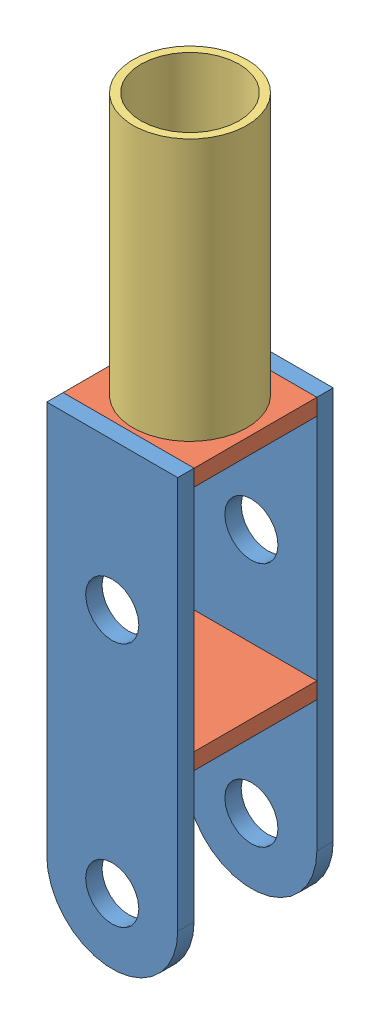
SolidWorks assembly Base Plate Adaptor Hinge.SLDASM, configuration Default (file format 10000). Lengths in mm.
Overall size (50.8 279.4 60.33).
5 component instances, 3 part files, 12 mates.
Components (placement in the parent):
- Base Adaptor-1: Base Adaptor.SLDPRT [Default] at (40.487 172.8879 139.5327) size (50.8 177.8 6.35)
- Base Adaptor-2: Base Adaptor.SLDPRT [Default] at (40.487 172.8879 85.5577) size (50.8 177.8 6.35)
- Base Adaptor Spacer-1: Base Adaptor Spacer.SLDPRT [Default] at (40.487 172.8879 91.9077) x (1 0 0) z (0 -1 0) size (50.8 47.62 6.35)
- Base Adaptor Spacer-2: Base Adaptor Spacer.SLDPRT [Default] at (40.487 77.6379 91.9077) x (1 0 0) z (0 -1 0) size (50.8 47.62 6.35)
- 1.5 ID Tubing-1: 1.5 ID Tubing.SLDPRT [Default] at (65.887 223.6879 115.7202) size (44.2 101.6 44.2)
Mates (geometry in assembly coordinates):
- Coincident1: coincident aligned: plane of Base Adaptor-1 through (91.287 20.4879 145.8827) normal (1 0 0); plane of Base Adaptor-2 through (91.287 20.4879 91.9077) normal (1 0 0)
- Coincident2: coincident aligned: plane of Base Adaptor-1 through (91.287 172.8879 145.8827) normal (0 1 0); plane of Base Adaptor-2 through (91.287 172.8879 91.9077) normal (0 1 0)
- Coincident3: coincident anti-aligned: plane of Base Adaptor-1 through (65.887 20.4879 139.5327) normal (0 0 -1); plane of Base Adaptor Spacer-1 through (40.487 166.5379 139.5327) normal (0 0 1)
- Coincident4: coincident aligned: plane of Base Adaptor-1 through (91.287 20.4879 145.8827) normal (1 0 0); plane of Base Adaptor Spacer-1 through (91.287 166.5379 91.9077) normal (1 0 0)
- Coincident5: coincident aligned: plane of Base Adaptor-1 through (91.287 172.8879 145.8827) normal (0 1 0); plane of Base Adaptor Spacer-1 through (40.487 172.8879 91.9077) normal (0 1 0)
- Coincident6: coincident anti-aligned: plane of Base Adaptor-2 through (65.887 20.4879 91.9077) normal (0 0 1); plane of Base Adaptor Spacer-1 through (40.487 166.5379 91.9077) normal (0 0 -1)
- Coincident7: coincident anti-aligned: plane of Base Adaptor-1 through (65.887 20.4879 139.5327) normal (0 0 -1); plane of Base Adaptor Spacer-2 through (40.487 71.2879 139.5327) normal (0 0 1)
- Coincident8: coincident aligned: plane of Base Adaptor-1 through (91.287 20.4879 145.8827) normal (1 0 0); plane of Base Adaptor Spacer-2 through (91.287 71.2879 91.9077) normal (1 0 0)
- Distance1: distance = 88.9 mm anti-aligned: plane of Base Adaptor Spacer-1 through (40.487 166.5379 91.9077) normal (0 -1 0); plane of Base Adaptor Spacer-2 through (40.487 77.6379 91.9077) normal (0 1 0)
- Coincident10: coincident anti-aligned: plane of Base Adaptor Spacer-1 through (40.487 172.8879 91.9077) normal (0 1 0); plane of 1.5 ID Tubing-1 through (65.887 172.8879 115.7202) normal (0 -1 0)
- Width1: width: plane of Base Adaptor Spacer-1 through (91.287 166.5379 91.9077) normal (1 0 0); plane of Base Adaptor Spacer-1 through (40.487 166.5379 91.9077) normal (-1 0 0); cylinder of 1.5 ID Tubing-1 through (65.887 274.4879 115.7202) axis (0 -1 0) radius 22.098
- Width2: width: plane of Base Adaptor-2 through (65.887 20.4879 85.5577) normal (0 0 -1); plane of Base Adaptor-1 through (65.887 20.4879 145.8827) normal (0 0 1); cylinder of 1.5 ID Tubing-1 through (65.887 274.4879 115.7202) axis (0 -1 0) radius 22.098
